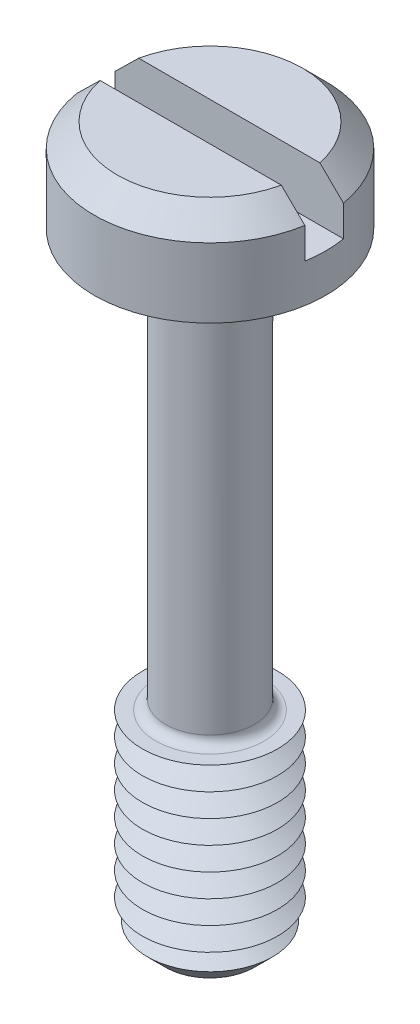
ISO-10303-21;
HEADER;
FILE_DESCRIPTION(('STEP AP214'),'2;1');
FILE_NAME('part.step','',(''),(''),'','','');
FILE_SCHEMA(('AUTOMOTIVE_DESIGN { 1 0 10303 214 1 1 1 1 }'));
ENDSEC;
DATA;
#1=APPLICATION_CONTEXT('core data for automotive mechanical design processes');
#2=APPLICATION_PROTOCOL_DEFINITION('international standard','automotive_design',2000,#1);
#3=PRODUCT_CONTEXT('',#1,'mechanical');
#4=PRODUCT('Part','Part','',(#3));
#5=PRODUCT_RELATED_PRODUCT_CATEGORY('part','',(#4));
#6=PRODUCT_DEFINITION_FORMATION('','',#4);
#7=PRODUCT_DEFINITION_CONTEXT('part definition',#1,'design');
#8=PRODUCT_DEFINITION('design','',#6,#7);
#9=PRODUCT_DEFINITION_SHAPE('','',#8);
#10=(LENGTH_UNIT() NAMED_UNIT(*) SI_UNIT(.MILLI.,.METRE.));
#11=(NAMED_UNIT(*) PLANE_ANGLE_UNIT() SI_UNIT($,.RADIAN.));
#12=(NAMED_UNIT(*) SI_UNIT($,.STERADIAN.) SOLID_ANGLE_UNIT());
#13=UNCERTAINTY_MEASURE_WITH_UNIT(LENGTH_MEASURE(1.E-05),#10,'distance_accuracy_value','');
#14=(GEOMETRIC_REPRESENTATION_CONTEXT(3) GLOBAL_UNCERTAINTY_ASSIGNED_CONTEXT((#13)) GLOBAL_UNIT_ASSIGNED_CONTEXT((#10,
#11,#12)) REPRESENTATION_CONTEXT('',''));
#15=CARTESIAN_POINT('',(0.,0.,0.));
#16=DIRECTION('',(0.,0.,1.));
#17=DIRECTION('',(1.,0.,0.));
#18=AXIS2_PLACEMENT_3D('',#15,#16,#17);
#19=CARTESIAN_POINT('',(0.,2.4,0.));
#20=DIRECTION('',(0.,1.,0.));
#21=DIRECTION('',(0.,0.,1.));
#22=AXIS2_PLACEMENT_3D('',#19,#20,#21);
#23=PLANE('',#22);
#24=DIRECTION('',(-1.,0.,0.));
#25=VECTOR('',#24,1.);
#26=CARTESIAN_POINT('',(3.,2.4,-0.5));
#27=LINE('',#26,#25);
#28=CARTESIAN_POINT('',(2.3473389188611,2.4,-0.5));
#29=VERTEX_POINT('',#28);
#30=CARTESIAN_POINT('',(-2.3473389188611,2.4,-0.5));
#31=VERTEX_POINT('',#30);
#32=EDGE_CURVE('E110',#29,#31,#27,.T.);
#33=ORIENTED_EDGE('',*,*,#32,.F.);
#34=CARTESIAN_POINT('',(0.,2.4,0.));
#35=DIRECTION('',(0.,1.,0.));
#36=DIRECTION('',(0.,0.,1.));
#37=AXIS2_PLACEMENT_3D('',#34,#35,#36);
#38=CIRCLE('',#37,2.4);
#39=EDGE_CURVE('E113',#29,#31,#38,.T.);
#40=ORIENTED_EDGE('',*,*,#39,.T.);
#41=EDGE_LOOP('',(#33,#40));
#42=FACE_BOUND('',#41,.T.);
#43=ADVANCED_FACE('F39',(#42),#23,.T.);
#44=CARTESIAN_POINT('',(0.,2.4,0.));
#45=DIRECTION('',(0.,-1.,0.));
#46=DIRECTION('',(0.,0.,-1.));
#47=AXIS2_PLACEMENT_3D('',#44,#45,#46);
#48=CONICAL_SURFACE('',#47,2.4,0.785398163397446);
#49=CARTESIAN_POINT('',(6.59924075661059,-1.81815522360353,-0.5));
#50=CARTESIAN_POINT('',(6.36552831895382,-1.58511655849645,-0.5));
#51=CARTESIAN_POINT('',(6.13178603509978,-1.3521077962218,-0.5));
#52=CARTESIAN_POINT('',(5.66419282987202,-0.886182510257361,-0.5));
#53=CARTESIAN_POINT('',(5.43034190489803,-0.653265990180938,-0.5));
#54=CARTESIAN_POINT('',(4.9622949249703,-0.187370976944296,-0.5));
#55=CARTESIAN_POINT('',(4.72809874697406,0.0456073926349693,-0.5));
#56=CARTESIAN_POINT('',(4.25949632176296,0.511336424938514,-0.5));
#57=CARTESIAN_POINT('',(4.02509008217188,0.744087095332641,-0.5));
#58=CARTESIAN_POINT('',(3.56605462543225,1.19918528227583,-0.5));
#59=CARTESIAN_POINT('',(3.34144041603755,1.42154792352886,-0.5));
#60=CARTESIAN_POINT('',(3.00406693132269,1.75465797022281,-0.5));
#61=CARTESIAN_POINT('',(2.89152775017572,1.8656282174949,-0.5));
#62=CARTESIAN_POINT('',(2.66624137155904,2.0873550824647,-0.5));
#63=CARTESIAN_POINT('',(2.5534941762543,2.19811170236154,-0.5));
#64=CARTESIAN_POINT('',(2.32775708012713,2.41925708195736,-0.5));
#65=CARTESIAN_POINT('',(2.21476734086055,2.52964600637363,-0.5));
#66=CARTESIAN_POINT('',(1.98831594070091,2.74994787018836,-0.5));
#67=CARTESIAN_POINT('',(1.87485426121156,2.85986079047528,-0.5));
#68=CARTESIAN_POINT('',(1.64719242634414,3.07888083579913,-0.5));
#69=CARTESIAN_POINT('',(1.53299241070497,3.18798810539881,-0.5));
#70=CARTESIAN_POINT('',(1.36063752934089,3.35052419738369,-0.5));
#71=CARTESIAN_POINT('',(1.30301197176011,3.40451369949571,-0.5));
#72=CARTESIAN_POINT('',(1.18725070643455,3.5119423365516,-0.5));
#73=CARTESIAN_POINT('',(1.12911501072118,3.56538148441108,-0.5));
#74=CARTESIAN_POINT('',(1.03810444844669,3.64783932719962,-0.5));
#75=CARTESIAN_POINT('',(1.0054935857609,3.67714917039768,-0.5));
#76=CARTESIAN_POINT('',(0.939964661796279,3.73543047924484,-0.5));
#77=CARTESIAN_POINT('',(0.907046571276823,3.76440191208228,-0.5));
#78=CARTESIAN_POINT('',(0.840581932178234,3.82209234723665,-0.5));
#79=CARTESIAN_POINT('',(0.807032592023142,3.85080814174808,-0.5));
#80=CARTESIAN_POINT('',(0.739406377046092,3.90759649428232,-0.5));
#81=CARTESIAN_POINT('',(0.705329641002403,3.93566921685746,-0.5));
#82=CARTESIAN_POINT('',(0.636165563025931,3.9911274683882,-0.5));
#83=CARTESIAN_POINT('',(0.601072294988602,4.01850564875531,-0.5));
#84=CARTESIAN_POINT('',(0.52984426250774,4.0718678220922,-0.5));
#85=CARTESIAN_POINT('',(0.493709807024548,4.09785222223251,-0.5));
#86=CARTESIAN_POINT('',(0.420142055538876,4.14747983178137,-0.5));
#87=CARTESIAN_POINT('',(0.382717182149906,4.17113535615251,-0.5));
#88=CARTESIAN_POINT('',(0.305809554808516,4.21475217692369,-0.5));
#89=CARTESIAN_POINT('',(0.26633263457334,4.234723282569,-0.5));
#90=CARTESIAN_POINT('',(0.194863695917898,4.26409059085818,-0.5));
#91=CARTESIAN_POINT('',(0.163467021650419,4.27488228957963,-0.5));
#92=CARTESIAN_POINT('',(0.0993951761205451,4.29114651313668,-0.5));
#93=CARTESIAN_POINT('',(0.0667267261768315,4.29664386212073,-0.5));
#94=CARTESIAN_POINT('',(0.000596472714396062,4.30109247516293,-0.5));
#95=CARTESIAN_POINT('',(-0.0328699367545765,4.29998037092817,-0.5));
#96=CARTESIAN_POINT('',(-0.0990204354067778,4.2913596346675,-0.5));
#97=CARTESIAN_POINT('',(-0.131701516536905,4.28382951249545,-0.5));
#98=CARTESIAN_POINT('',(-0.187595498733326,4.2664576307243,-0.5));
#99=CARTESIAN_POINT('',(-0.211151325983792,4.25764794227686,-0.5));
#100=CARTESIAN_POINT('',(-0.257419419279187,4.23801581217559,-0.5));
#101=CARTESIAN_POINT('',(-0.280131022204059,4.22719182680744,-0.5));
#102=CARTESIAN_POINT('',(-0.324887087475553,4.20402808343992,-0.5));
#103=CARTESIAN_POINT('',(-0.346927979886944,4.19168154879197,-0.5));
#104=CARTESIAN_POINT('',(-0.39035074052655,4.16590953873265,-0.5));
#105=CARTESIAN_POINT('',(-0.41173287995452,4.15248451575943,-0.5));
#106=CARTESIAN_POINT('',(-0.483200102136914,4.1057271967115,-0.5));
#107=CARTESIAN_POINT('',(-0.532069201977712,4.07054939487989,-0.5));
#108=CARTESIAN_POINT('',(-0.628034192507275,3.99783710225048,-0.5));
#109=CARTESIAN_POINT('',(-0.675128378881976,3.96030043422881,-0.5));
#110=CARTESIAN_POINT('',(-0.768277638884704,3.88373232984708,-0.5));
#111=CARTESIAN_POINT('',(-0.814329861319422,3.84469743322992,-0.5));
#112=CARTESIAN_POINT('',(-0.90564084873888,3.76575507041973,-0.5));
#113=CARTESIAN_POINT('',(-0.950899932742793,3.72584797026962,-0.5));
#114=CARTESIAN_POINT('',(-1.04097019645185,3.64535266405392,-0.5));
#115=CARTESIAN_POINT('',(-1.08578029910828,3.60476325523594,-0.5));
#116=CARTESIAN_POINT('',(-1.17501433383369,3.52315414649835,-0.5));
#117=CARTESIAN_POINT('',(-1.21943822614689,3.48213440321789,-0.5));
#118=CARTESIAN_POINT('',(-1.35214179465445,3.35874463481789,-0.5));
#119=CARTESIAN_POINT('',(-1.43999477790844,3.27591618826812,-0.5));
#120=CARTESIAN_POINT('',(-1.61421087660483,3.11033648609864,-0.5));
#121=CARTESIAN_POINT('',(-1.70058023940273,3.02759177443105,-0.5));
#122=CARTESIAN_POINT('',(-1.87288923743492,2.86165572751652,-0.5));
#123=CARTESIAN_POINT('',(-1.95882887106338,2.77846439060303,-0.5));
#124=CARTESIAN_POINT('',(-2.21622491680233,2.52844403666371,-0.5));
#125=CARTESIAN_POINT('',(-2.38725269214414,2.3611742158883,-0.5));
#126=CARTESIAN_POINT('',(-2.72882612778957,2.02593191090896,-0.5));
#127=CARTESIAN_POINT('',(-2.89937142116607,1.8579590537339,-0.5));
#128=CARTESIAN_POINT('',(-3.24010524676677,1.52165721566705,-0.5));
#129=CARTESIAN_POINT('',(-3.41029378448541,1.35332824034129,-0.5));
#130=CARTESIAN_POINT('',(-3.75003309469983,1.0168528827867,-0.5));
#131=CARTESIAN_POINT('',(-3.91958441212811,0.848707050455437,-0.5));
#132=CARTESIAN_POINT('',(-4.25853538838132,0.512261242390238,-0.5));
#133=CARTESIAN_POINT('',(-4.42793504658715,0.343961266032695,-0.5));
#134=CARTESIAN_POINT('',(-4.9359209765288,-0.16104405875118,-0.5));
#135=CARTESIAN_POINT('',(-5.27434871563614,-0.497908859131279,-0.5));
#136=CARTESIAN_POINT('',(-5.69486651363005,-0.916769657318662,-0.5));
#137=CARTESIAN_POINT('',(-5.77706453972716,-0.998657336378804,-0.5));
#138=CARTESIAN_POINT('',(-5.94145013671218,-1.16244746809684,-0.5));
#139=CARTESIAN_POINT('',(-6.02363770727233,-1.24434992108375,-0.5));
#140=CARTESIAN_POINT('',(-6.1880679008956,-1.40823159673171,-0.5));
#141=CARTESIAN_POINT('',(-6.27031051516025,-1.49021082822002,-0.5));
#142=CARTESIAN_POINT('',(-6.4347837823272,-1.65417699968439,-0.5));
#143=CARTESIAN_POINT('',(-6.51701443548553,-1.73616393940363,-0.5));
#144=CARTESIAN_POINT('',(-6.59924075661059,-1.81815522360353,-0.5));
#145=B_SPLINE_CURVE_WITH_KNOTS('',3,(#49,#50,#51,#52,#53,#54,#55,#56,#57,#58,#59,#60,#61,#62,
#63,#64,#65,#66,#67,#68,#69,#70,#71,#72,#73,#74,#75,#76,#77,#78,#79,#80,#81,#82,#83,#84,#85,#86,
#87,#88,#89,#90,#91,#92,#93,#94,#95,#96,#97,#98,#99,#100,#101,#102,#103,#104,#105,#106,#107,
#108,#109,#110,#111,#112,#113,#114,#115,#116,#117,#118,#119,#120,#121,#122,#123,#124,#125,#126,
#127,#128,#129,#130,#131,#132,#133,#134,#135,#136,#137,#138,#139,#140,#141,#142,#143,#144),
.UNSPECIFIED.,.F.,.F.,(4,2,2,2,2,2,2,2,2,2,2,2,2,2,2,2,2,2,2,2,2,2,2,2,2,2,2,2,2,2,2,2,2,2,2,2,
2,2,2,2,2,2,2,2,2,2,2,4),(0.,0.990129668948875,1.98029489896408,2.97132503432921,3.96232055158,
4.91051293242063,5.384659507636,5.85880117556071,6.3326899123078,6.80659750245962,
7.28041788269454,7.51731276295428,7.75420207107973,7.88574051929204,8.01729161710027,
8.14976780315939,8.28220970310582,8.41571746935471,8.54918601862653,8.68190589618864,
8.81426715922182,8.91354607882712,9.01235719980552,9.1121171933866,9.21221254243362,
9.28755627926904,9.36295799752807,9.43870832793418,9.51442704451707,9.69490147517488,
9.87554500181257,10.0566343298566,10.2376490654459,10.4190258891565,10.6004211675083,
10.9626397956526,11.3214656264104,11.6802927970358,12.3979711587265,13.1160968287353,
13.8342113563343,14.5505812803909,15.2669541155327,16.6994694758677,17.0475484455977,
17.3956364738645,17.7440040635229,18.0923625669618),.UNSPECIFIED.);
#146=CARTESIAN_POINT('',(2.95803989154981,1.8,-0.5));
#147=VERTEX_POINT('',#146);
#148=EDGE_CURVE('E259',#147,#29,#145,.T.);
#149=ORIENTED_EDGE('',*,*,#148,.F.);
#150=CARTESIAN_POINT('',(0.,1.8,0.));
#151=DIRECTION('',(0.,1.,0.));
#152=DIRECTION('',(0.,0.,1.));
#153=AXIS2_PLACEMENT_3D('',#150,#151,#152);
#154=CIRCLE('',#153,3.);
#155=CARTESIAN_POINT('',(-2.95803989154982,1.79999999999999,-0.5));
#156=VERTEX_POINT('',#155);
#157=EDGE_CURVE('E127',#156,#147,#154,.F.);
#158=ORIENTED_EDGE('',*,*,#157,.F.);
#159=EDGE_CURVE('E102',#31,#156,#145,.T.);
#160=ORIENTED_EDGE('',*,*,#159,.F.);
#161=ORIENTED_EDGE('',*,*,#39,.F.);
#162=EDGE_LOOP('',(#149,#158,#160,#161));
#163=FACE_BOUND('',#162,.T.);
#164=ADVANCED_FACE('F221',(#163),#48,.T.);
#165=CARTESIAN_POINT('',(0.,-16.,0.));
#166=DIRECTION('',(0.,1.,0.));
#167=DIRECTION('',(0.,0.,1.));
#168=AXIS2_PLACEMENT_3D('',#165,#166,#167);
#169=CYLINDRICAL_SURFACE('',#168,1.15);
#170=CARTESIAN_POINT('',(0.,-10.55,0.));
#171=DIRECTION('',(0.,-1.,0.));
#172=DIRECTION('',(0.,0.,-1.));
#173=AXIS2_PLACEMENT_3D('',#170,#171,#172);
#174=CIRCLE('',#173,1.15);
#175=CARTESIAN_POINT('',(0.,-10.55,-1.15));
#176=VERTEX_POINT('',#175);
#177=EDGE_CURVE('E122',#176,#176,#174,.F.);
#178=ORIENTED_EDGE('',*,*,#177,.T.);
#179=EDGE_LOOP('',(#178));
#180=FACE_BOUND('',#179,.T.);
#181=CARTESIAN_POINT('',(0.,-0.25,0.));
#182=DIRECTION('',(0.,1.,0.));
#183=DIRECTION('',(0.,0.,1.));
#184=AXIS2_PLACEMENT_3D('',#181,#182,#183);
#185=CIRCLE('',#184,1.15);
#186=CARTESIAN_POINT('',(0.,-0.25,1.15));
#187=VERTEX_POINT('',#186);
#188=EDGE_CURVE('E366',#187,#187,#185,.F.);
#189=ORIENTED_EDGE('',*,*,#188,.T.);
#190=EDGE_LOOP('',(#189));
#191=FACE_BOUND('',#190,.T.);
#192=ADVANCED_FACE('F217',(#180,#191),#169,.T.);
#193=CARTESIAN_POINT('',(0.,2.4,0.));
#194=DIRECTION('',(0.,-1.,0.));
#195=DIRECTION('',(0.,0.,-1.));
#196=AXIS2_PLACEMENT_3D('',#193,#194,#195);
#197=CYLINDRICAL_SURFACE('',#196,3.);
#198=ORIENTED_EDGE('',*,*,#157,.T.);
#199=DIRECTION('',(0.,-1.,0.));
#200=VECTOR('',#199,1.);
#201=CARTESIAN_POINT('',(2.95803989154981,2.4,-0.5));
#202=LINE('',#201,#200);
#203=CARTESIAN_POINT('',(2.95803989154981,1.,-0.5));
#204=VERTEX_POINT('',#203);
#205=EDGE_CURVE('E64',#147,#204,#202,.T.);
#206=ORIENTED_EDGE('',*,*,#205,.T.);
#207=CARTESIAN_POINT('',(0.,1.,0.));
#208=DIRECTION('',(0.,1.,0.));
#209=DIRECTION('',(0.,0.,1.));
#210=AXIS2_PLACEMENT_3D('',#207,#208,#209);
#211=CIRCLE('',#210,3.);
#212=CARTESIAN_POINT('',(2.95803989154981,1.,0.5));
#213=VERTEX_POINT('',#212);
#214=EDGE_CURVE('E11',#213,#204,#211,.T.);
#215=ORIENTED_EDGE('',*,*,#214,.F.);
#216=DIRECTION('',(0.,-1.,0.));
#217=VECTOR('',#216,1.);
#218=CARTESIAN_POINT('',(2.95803989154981,2.4,0.5));
#219=LINE('',#218,#217);
#220=CARTESIAN_POINT('',(2.95803989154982,1.79999999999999,0.5));
#221=VERTEX_POINT('',#220);
#222=EDGE_CURVE('E276',#213,#221,#219,.F.);
#223=ORIENTED_EDGE('',*,*,#222,.T.);
#224=CARTESIAN_POINT('',(-2.95803989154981,1.8,0.5));
#225=VERTEX_POINT('',#224);
#226=EDGE_CURVE('E120',#221,#225,#154,.F.);
#227=ORIENTED_EDGE('',*,*,#226,.T.);
#228=DIRECTION('',(0.,-1.,0.));
#229=VECTOR('',#228,1.);
#230=CARTESIAN_POINT('',(-2.95803989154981,2.4,0.5));
#231=LINE('',#230,#229);
#232=CARTESIAN_POINT('',(-2.95803989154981,1.,0.5));
#233=VERTEX_POINT('',#232);
#234=EDGE_CURVE('E96',#225,#233,#231,.T.);
#235=ORIENTED_EDGE('',*,*,#234,.T.);
#236=CARTESIAN_POINT('',(-2.95803989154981,1.,-0.5));
#237=VERTEX_POINT('',#236);
#238=EDGE_CURVE('E44',#237,#233,#211,.T.);
#239=ORIENTED_EDGE('',*,*,#238,.F.);
#240=DIRECTION('',(0.,-1.,0.));
#241=VECTOR('',#240,1.);
#242=CARTESIAN_POINT('',(-2.95803989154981,2.4,-0.5));
#243=LINE('',#242,#241);
#244=EDGE_CURVE('E280',#237,#156,#243,.F.);
#245=ORIENTED_EDGE('',*,*,#244,.T.);
#246=EDGE_LOOP('',(#198,#206,#215,#223,#227,#235,#239,#245));
#247=FACE_BOUND('',#246,.T.);
#248=CARTESIAN_POINT('',(0.,0.,0.));
#249=DIRECTION('',(0.,1.,0.));
#250=DIRECTION('',(0.,0.,1.));
#251=AXIS2_PLACEMENT_3D('',#248,#249,#250);
#252=CIRCLE('',#251,3.);
#253=CARTESIAN_POINT('',(0.,0.,3.));
#254=VERTEX_POINT('',#253);
#255=EDGE_CURVE('E351',#254,#254,#252,.T.);
#256=ORIENTED_EDGE('',*,*,#255,.T.);
#257=EDGE_LOOP('',(#256));
#258=FACE_BOUND('',#257,.T.);
#259=ADVANCED_FACE('F220',(#247,#258),#197,.T.);
#260=DIRECTION('',(1.,0.,0.));
#261=VECTOR('',#260,1.);
#262=CARTESIAN_POINT('',(3.,2.4,0.5));
#263=LINE('',#262,#261);
#264=CARTESIAN_POINT('',(-2.3473389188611,2.4,0.5));
#265=VERTEX_POINT('',#264);
#266=CARTESIAN_POINT('',(2.3473389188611,2.4,0.5));
#267=VERTEX_POINT('',#266);
#268=EDGE_CURVE('E56',#265,#267,#263,.T.);
#269=ORIENTED_EDGE('',*,*,#268,.F.);
#270=EDGE_CURVE('E108',#265,#267,#38,.T.);
#271=ORIENTED_EDGE('',*,*,#270,.T.);
#272=EDGE_LOOP('',(#269,#271));
#273=FACE_BOUND('',#272,.T.);
#274=ADVANCED_FACE('F107',(#273),#23,.T.);
#275=CARTESIAN_POINT('',(0.,0.,0.));
#276=DIRECTION('',(0.,1.,0.));
#277=DIRECTION('',(0.,0.,1.));
#278=AXIS2_PLACEMENT_3D('',#275,#276,#277);
#279=PLANE('',#278);
#280=CARTESIAN_POINT('',(0.,0.,0.));
#281=DIRECTION('',(0.,1.,0.));
#282=DIRECTION('',(0.,0.,1.));
#283=AXIS2_PLACEMENT_3D('',#280,#281,#282);
#284=CIRCLE('',#283,1.4);
#285=CARTESIAN_POINT('',(0.,0.,1.4));
#286=VERTEX_POINT('',#285);
#287=EDGE_CURVE('E114',#286,#286,#284,.T.);
#288=ORIENTED_EDGE('',*,*,#287,.T.);
#289=EDGE_LOOP('',(#288));
#290=FACE_BOUND('',#289,.T.);
#291=ORIENTED_EDGE('',*,*,#255,.F.);
#292=EDGE_LOOP('',(#291));
#293=FACE_BOUND('',#292,.T.);
#294=ADVANCED_FACE('F211',(#290,#293),#279,.F.);
#295=CARTESIAN_POINT('',(0.,-10.8,0.));
#296=DIRECTION('',(0.,-1.,0.));
#297=DIRECTION('',(0.,0.,-1.));
#298=AXIS2_PLACEMENT_3D('',#295,#296,#297);
#299=PLANE('',#298);
#300=CARTESIAN_POINT('',(0.,-10.8,0.));
#301=DIRECTION('',(0.,-1.,0.));
#302=DIRECTION('',(0.,0.,-1.));
#303=AXIS2_PLACEMENT_3D('',#300,#301,#302);
#304=CIRCLE('',#303,1.4);
#305=CARTESIAN_POINT('',(0.,-10.8,-1.4));
#306=VERTEX_POINT('',#305);
#307=EDGE_CURVE('E359',#306,#306,#304,.T.);
#308=ORIENTED_EDGE('',*,*,#307,.T.);
#309=EDGE_LOOP('',(#308));
#310=FACE_BOUND('',#309,.T.);
#311=CARTESIAN_POINT('',(0.,-10.8,0.));
#312=DIRECTION('',(0.,1.,0.));
#313=DIRECTION('',(0.,0.,1.));
#314=AXIS2_PLACEMENT_3D('',#311,#312,#313);
#315=CIRCLE('',#314,1.75);
#316=CARTESIAN_POINT('',(0.,-10.8,1.75));
#317=VERTEX_POINT('',#316);
#318=EDGE_CURVE('E347',#317,#317,#315,.T.);
#319=ORIENTED_EDGE('',*,*,#318,.T.);
#320=EDGE_LOOP('',(#319));
#321=FACE_BOUND('',#320,.T.);
#322=ADVANCED_FACE('F207',(#310,#321),#299,.F.);
#323=CARTESIAN_POINT('',(0.,-11.1,0.));
#324=DIRECTION('',(0.,1.,0.));
#325=DIRECTION('',(0.,0.,1.));
#326=AXIS2_PLACEMENT_3D('',#323,#324,#325);
#327=CONICAL_SURFACE('',#326,1.23038475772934,1.0471975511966);
#328=ORIENTED_EDGE('',*,*,#318,.F.);
#329=EDGE_LOOP('',(#328));
#330=FACE_BOUND('',#329,.T.);
#331=CARTESIAN_POINT('',(0.,-11.1,0.));
#332=DIRECTION('',(0.,1.,0.));
#333=DIRECTION('',(0.,0.,1.));
#334=AXIS2_PLACEMENT_3D('',#331,#332,#333);
#335=CIRCLE('',#334,1.23038475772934);
#336=CARTESIAN_POINT('',(0.,-11.1,1.23038475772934));
#337=VERTEX_POINT('',#336);
#338=EDGE_CURVE('E344',#337,#337,#335,.T.);
#339=ORIENTED_EDGE('',*,*,#338,.T.);
#340=EDGE_LOOP('',(#339));
#341=FACE_BOUND('',#340,.T.);
#342=ADVANCED_FACE('F203',(#330,#341),#327,.T.);
#343=CARTESIAN_POINT('',(0.,-11.4,0.));
#344=DIRECTION('',(0.,-1.,0.));
#345=DIRECTION('',(0.,0.,-1.));
#346=AXIS2_PLACEMENT_3D('',#343,#344,#345);
#347=CONICAL_SURFACE('',#346,1.75,1.0471975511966);
#348=ORIENTED_EDGE('',*,*,#338,.F.);
#349=EDGE_LOOP('',(#348));
#350=FACE_BOUND('',#349,.T.);
#351=CARTESIAN_POINT('',(0.,-11.4,0.));
#352=DIRECTION('',(0.,1.,0.));
#353=DIRECTION('',(0.,0.,1.));
#354=AXIS2_PLACEMENT_3D('',#351,#352,#353);
#355=CIRCLE('',#354,1.75);
#356=CARTESIAN_POINT('',(0.,-11.4,1.75));
#357=VERTEX_POINT('',#356);
#358=EDGE_CURVE('E340',#357,#357,#355,.T.);
#359=ORIENTED_EDGE('',*,*,#358,.T.);
#360=EDGE_LOOP('',(#359));
#361=FACE_BOUND('',#360,.T.);
#362=ADVANCED_FACE('F199',(#350,#361),#347,.T.);
#363=CARTESIAN_POINT('',(0.,-11.7,0.));
#364=DIRECTION('',(0.,1.,0.));
#365=DIRECTION('',(0.,0.,1.));
#366=AXIS2_PLACEMENT_3D('',#363,#364,#365);
#367=CONICAL_SURFACE('',#366,1.23038475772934,1.0471975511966);
#368=ORIENTED_EDGE('',*,*,#358,.F.);
#369=EDGE_LOOP('',(#368));
#370=FACE_BOUND('',#369,.T.);
#371=CARTESIAN_POINT('',(0.,-11.7,0.));
#372=DIRECTION('',(0.,1.,0.));
#373=DIRECTION('',(0.,0.,1.));
#374=AXIS2_PLACEMENT_3D('',#371,#372,#373);
#375=CIRCLE('',#374,1.23038475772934);
#376=CARTESIAN_POINT('',(0.,-11.7,1.23038475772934));
#377=VERTEX_POINT('',#376);
#378=EDGE_CURVE('E337',#377,#377,#375,.T.);
#379=ORIENTED_EDGE('',*,*,#378,.T.);
#380=EDGE_LOOP('',(#379));
#381=FACE_BOUND('',#380,.T.);
#382=ADVANCED_FACE('F195',(#370,#381),#367,.T.);
#383=CARTESIAN_POINT('',(0.,-12.,0.));
#384=DIRECTION('',(0.,-1.,0.));
#385=DIRECTION('',(0.,0.,-1.));
#386=AXIS2_PLACEMENT_3D('',#383,#384,#385);
#387=CONICAL_SURFACE('',#386,1.75,1.0471975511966);
#388=ORIENTED_EDGE('',*,*,#378,.F.);
#389=EDGE_LOOP('',(#388));
#390=FACE_BOUND('',#389,.T.);
#391=CARTESIAN_POINT('',(0.,-12.,0.));
#392=DIRECTION('',(0.,1.,0.));
#393=DIRECTION('',(0.,0.,1.));
#394=AXIS2_PLACEMENT_3D('',#391,#392,#393);
#395=CIRCLE('',#394,1.75);
#396=CARTESIAN_POINT('',(0.,-12.,1.75));
#397=VERTEX_POINT('',#396);
#398=EDGE_CURVE('E334',#397,#397,#395,.T.);
#399=ORIENTED_EDGE('',*,*,#398,.T.);
#400=EDGE_LOOP('',(#399));
#401=FACE_BOUND('',#400,.T.);
#402=ADVANCED_FACE('F191',(#390,#401),#387,.T.);
#403=CARTESIAN_POINT('',(0.,-12.3,0.));
#404=DIRECTION('',(0.,1.,0.));
#405=DIRECTION('',(0.,0.,1.));
#406=AXIS2_PLACEMENT_3D('',#403,#404,#405);
#407=CONICAL_SURFACE('',#406,1.23038475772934,1.0471975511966);
#408=ORIENTED_EDGE('',*,*,#398,.F.);
#409=EDGE_LOOP('',(#408));
#410=FACE_BOUND('',#409,.T.);
#411=CARTESIAN_POINT('',(0.,-12.3,0.));
#412=DIRECTION('',(0.,1.,0.));
#413=DIRECTION('',(0.,0.,1.));
#414=AXIS2_PLACEMENT_3D('',#411,#412,#413);
#415=CIRCLE('',#414,1.23038475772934);
#416=CARTESIAN_POINT('',(0.,-12.3,1.23038475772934));
#417=VERTEX_POINT('',#416);
#418=EDGE_CURVE('E330',#417,#417,#415,.T.);
#419=ORIENTED_EDGE('',*,*,#418,.T.);
#420=EDGE_LOOP('',(#419));
#421=FACE_BOUND('',#420,.T.);
#422=ADVANCED_FACE('F187',(#410,#421),#407,.T.);
#423=CARTESIAN_POINT('',(0.,-12.6,0.));
#424=DIRECTION('',(0.,-1.,0.));
#425=DIRECTION('',(0.,0.,-1.));
#426=AXIS2_PLACEMENT_3D('',#423,#424,#425);
#427=CONICAL_SURFACE('',#426,1.75,1.0471975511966);
#428=ORIENTED_EDGE('',*,*,#418,.F.);
#429=EDGE_LOOP('',(#428));
#430=FACE_BOUND('',#429,.T.);
#431=CARTESIAN_POINT('',(0.,-12.6,0.));
#432=DIRECTION('',(0.,1.,0.));
#433=DIRECTION('',(0.,0.,1.));
#434=AXIS2_PLACEMENT_3D('',#431,#432,#433);
#435=CIRCLE('',#434,1.75);
#436=CARTESIAN_POINT('',(0.,-12.6,1.75));
#437=VERTEX_POINT('',#436);
#438=EDGE_CURVE('E326',#437,#437,#435,.T.);
#439=ORIENTED_EDGE('',*,*,#438,.T.);
#440=EDGE_LOOP('',(#439));
#441=FACE_BOUND('',#440,.T.);
#442=ADVANCED_FACE('F183',(#430,#441),#427,.T.);
#443=CARTESIAN_POINT('',(0.,-12.9,0.));
#444=DIRECTION('',(0.,1.,0.));
#445=DIRECTION('',(0.,0.,1.));
#446=AXIS2_PLACEMENT_3D('',#443,#444,#445);
#447=CONICAL_SURFACE('',#446,1.23038475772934,1.0471975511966);
#448=ORIENTED_EDGE('',*,*,#438,.F.);
#449=EDGE_LOOP('',(#448));
#450=FACE_BOUND('',#449,.T.);
#451=CARTESIAN_POINT('',(0.,-12.9,0.));
#452=DIRECTION('',(0.,1.,0.));
#453=DIRECTION('',(0.,0.,1.));
#454=AXIS2_PLACEMENT_3D('',#451,#452,#453);
#455=CIRCLE('',#454,1.23038475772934);
#456=CARTESIAN_POINT('',(0.,-12.9,1.23038475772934));
#457=VERTEX_POINT('',#456);
#458=EDGE_CURVE('E322',#457,#457,#455,.T.);
#459=ORIENTED_EDGE('',*,*,#458,.T.);
#460=EDGE_LOOP('',(#459));
#461=FACE_BOUND('',#460,.T.);
#462=ADVANCED_FACE('F179',(#450,#461),#447,.T.);
#463=CARTESIAN_POINT('',(0.,-13.2,0.));
#464=DIRECTION('',(0.,-1.,0.));
#465=DIRECTION('',(0.,0.,-1.));
#466=AXIS2_PLACEMENT_3D('',#463,#464,#465);
#467=CONICAL_SURFACE('',#466,1.75,1.0471975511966);
#468=ORIENTED_EDGE('',*,*,#458,.F.);
#469=EDGE_LOOP('',(#468));
#470=FACE_BOUND('',#469,.T.);
#471=CARTESIAN_POINT('',(0.,-13.2,0.));
#472=DIRECTION('',(0.,1.,0.));
#473=DIRECTION('',(0.,0.,1.));
#474=AXIS2_PLACEMENT_3D('',#471,#472,#473);
#475=CIRCLE('',#474,1.75);
#476=CARTESIAN_POINT('',(0.,-13.2,1.75));
#477=VERTEX_POINT('',#476);
#478=EDGE_CURVE('E318',#477,#477,#475,.T.);
#479=ORIENTED_EDGE('',*,*,#478,.T.);
#480=EDGE_LOOP('',(#479));
#481=FACE_BOUND('',#480,.T.);
#482=ADVANCED_FACE('F175',(#470,#481),#467,.T.);
#483=CARTESIAN_POINT('',(0.,-13.5,0.));
#484=DIRECTION('',(0.,1.,0.));
#485=DIRECTION('',(0.,0.,1.));
#486=AXIS2_PLACEMENT_3D('',#483,#484,#485);
#487=CONICAL_SURFACE('',#486,1.23038475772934,1.0471975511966);
#488=ORIENTED_EDGE('',*,*,#478,.F.);
#489=EDGE_LOOP('',(#488));
#490=FACE_BOUND('',#489,.T.);
#491=CARTESIAN_POINT('',(0.,-13.5,0.));
#492=DIRECTION('',(0.,1.,0.));
#493=DIRECTION('',(0.,0.,1.));
#494=AXIS2_PLACEMENT_3D('',#491,#492,#493);
#495=CIRCLE('',#494,1.23038475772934);
#496=CARTESIAN_POINT('',(0.,-13.5,1.23038475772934));
#497=VERTEX_POINT('',#496);
#498=EDGE_CURVE('E314',#497,#497,#495,.T.);
#499=ORIENTED_EDGE('',*,*,#498,.T.);
#500=EDGE_LOOP('',(#499));
#501=FACE_BOUND('',#500,.T.);
#502=ADVANCED_FACE('F171',(#490,#501),#487,.T.);
#503=CARTESIAN_POINT('',(0.,-13.8,0.));
#504=DIRECTION('',(0.,-1.,0.));
#505=DIRECTION('',(0.,0.,-1.));
#506=AXIS2_PLACEMENT_3D('',#503,#504,#505);
#507=CONICAL_SURFACE('',#506,1.75,1.0471975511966);
#508=ORIENTED_EDGE('',*,*,#498,.F.);
#509=EDGE_LOOP('',(#508));
#510=FACE_BOUND('',#509,.T.);
#511=CARTESIAN_POINT('',(0.,-13.8,0.));
#512=DIRECTION('',(0.,1.,0.));
#513=DIRECTION('',(0.,0.,1.));
#514=AXIS2_PLACEMENT_3D('',#511,#512,#513);
#515=CIRCLE('',#514,1.75);
#516=CARTESIAN_POINT('',(0.,-13.8,1.75));
#517=VERTEX_POINT('',#516);
#518=EDGE_CURVE('E310',#517,#517,#515,.T.);
#519=ORIENTED_EDGE('',*,*,#518,.T.);
#520=EDGE_LOOP('',(#519));
#521=FACE_BOUND('',#520,.T.);
#522=ADVANCED_FACE('F167',(#510,#521),#507,.T.);
#523=CARTESIAN_POINT('',(0.,-14.1,0.));
#524=DIRECTION('',(0.,1.,0.));
#525=DIRECTION('',(0.,0.,1.));
#526=AXIS2_PLACEMENT_3D('',#523,#524,#525);
#527=CONICAL_SURFACE('',#526,1.23038475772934,1.0471975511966);
#528=ORIENTED_EDGE('',*,*,#518,.F.);
#529=EDGE_LOOP('',(#528));
#530=FACE_BOUND('',#529,.T.);
#531=CARTESIAN_POINT('',(0.,-14.1,0.));
#532=DIRECTION('',(0.,1.,0.));
#533=DIRECTION('',(0.,0.,1.));
#534=AXIS2_PLACEMENT_3D('',#531,#532,#533);
#535=CIRCLE('',#534,1.23038475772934);
#536=CARTESIAN_POINT('',(0.,-14.1,1.23038475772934));
#537=VERTEX_POINT('',#536);
#538=EDGE_CURVE('E306',#537,#537,#535,.T.);
#539=ORIENTED_EDGE('',*,*,#538,.T.);
#540=EDGE_LOOP('',(#539));
#541=FACE_BOUND('',#540,.T.);
#542=ADVANCED_FACE('F163',(#530,#541),#527,.T.);
#543=CARTESIAN_POINT('',(0.,-14.4,0.));
#544=DIRECTION('',(0.,-1.,0.));
#545=DIRECTION('',(0.,0.,-1.));
#546=AXIS2_PLACEMENT_3D('',#543,#544,#545);
#547=CONICAL_SURFACE('',#546,1.75,1.0471975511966);
#548=ORIENTED_EDGE('',*,*,#538,.F.);
#549=EDGE_LOOP('',(#548));
#550=FACE_BOUND('',#549,.T.);
#551=CARTESIAN_POINT('',(0.,-14.4,0.));
#552=DIRECTION('',(0.,1.,0.));
#553=DIRECTION('',(0.,0.,1.));
#554=AXIS2_PLACEMENT_3D('',#551,#552,#553);
#555=CIRCLE('',#554,1.75);
#556=CARTESIAN_POINT('',(0.,-14.4,1.75));
#557=VERTEX_POINT('',#556);
#558=EDGE_CURVE('E302',#557,#557,#555,.T.);
#559=ORIENTED_EDGE('',*,*,#558,.T.);
#560=EDGE_LOOP('',(#559));
#561=FACE_BOUND('',#560,.T.);
#562=ADVANCED_FACE('F159',(#550,#561),#547,.T.);
#563=CARTESIAN_POINT('',(0.,-14.7,0.));
#564=DIRECTION('',(0.,1.,0.));
#565=DIRECTION('',(0.,0.,1.));
#566=AXIS2_PLACEMENT_3D('',#563,#564,#565);
#567=CONICAL_SURFACE('',#566,1.23038475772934,1.0471975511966);
#568=ORIENTED_EDGE('',*,*,#558,.F.);
#569=EDGE_LOOP('',(#568));
#570=FACE_BOUND('',#569,.T.);
#571=CARTESIAN_POINT('',(0.,-14.7,0.));
#572=DIRECTION('',(0.,1.,0.));
#573=DIRECTION('',(0.,0.,1.));
#574=AXIS2_PLACEMENT_3D('',#571,#572,#573);
#575=CIRCLE('',#574,1.23038475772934);
#576=CARTESIAN_POINT('',(0.,-14.7,1.23038475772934));
#577=VERTEX_POINT('',#576);
#578=EDGE_CURVE('E298',#577,#577,#575,.T.);
#579=ORIENTED_EDGE('',*,*,#578,.T.);
#580=EDGE_LOOP('',(#579));
#581=FACE_BOUND('',#580,.T.);
#582=ADVANCED_FACE('F155',(#570,#581),#567,.T.);
#583=CARTESIAN_POINT('',(0.,-15.,0.));
#584=DIRECTION('',(0.,-1.,0.));
#585=DIRECTION('',(0.,0.,-1.));
#586=AXIS2_PLACEMENT_3D('',#583,#584,#585);
#587=CONICAL_SURFACE('',#586,1.75,1.0471975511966);
#588=ORIENTED_EDGE('',*,*,#578,.F.);
#589=EDGE_LOOP('',(#588));
#590=FACE_BOUND('',#589,.T.);
#591=CARTESIAN_POINT('',(0.,-15.,0.));
#592=DIRECTION('',(0.,1.,0.));
#593=DIRECTION('',(0.,0.,1.));
#594=AXIS2_PLACEMENT_3D('',#591,#592,#593);
#595=CIRCLE('',#594,1.75);
#596=CARTESIAN_POINT('',(0.,-15.,1.75));
#597=VERTEX_POINT('',#596);
#598=EDGE_CURVE('E294',#597,#597,#595,.T.);
#599=ORIENTED_EDGE('',*,*,#598,.T.);
#600=EDGE_LOOP('',(#599));
#601=FACE_BOUND('',#600,.T.);
#602=ADVANCED_FACE('F151',(#590,#601),#587,.T.);
#603=CARTESIAN_POINT('',(0.,-15.3,0.));
#604=DIRECTION('',(0.,1.,0.));
#605=DIRECTION('',(0.,0.,1.));
#606=AXIS2_PLACEMENT_3D('',#603,#604,#605);
#607=CONICAL_SURFACE('',#606,1.23038475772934,1.0471975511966);
#608=ORIENTED_EDGE('',*,*,#598,.F.);
#609=EDGE_LOOP('',(#608));
#610=FACE_BOUND('',#609,.T.);
#611=CARTESIAN_POINT('',(0.,-15.3,0.));
#612=DIRECTION('',(0.,1.,0.));
#613=DIRECTION('',(0.,0.,1.));
#614=AXIS2_PLACEMENT_3D('',#611,#612,#613);
#615=CIRCLE('',#614,1.23038475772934);
#616=CARTESIAN_POINT('',(0.,-15.3,1.23038475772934));
#617=VERTEX_POINT('',#616);
#618=EDGE_CURVE('E290',#617,#617,#615,.T.);
#619=ORIENTED_EDGE('',*,*,#618,.T.);
#620=EDGE_LOOP('',(#619));
#621=FACE_BOUND('',#620,.T.);
#622=ADVANCED_FACE('F147',(#610,#621),#607,.T.);
#623=CARTESIAN_POINT('',(0.,-15.6,0.));
#624=DIRECTION('',(0.,-1.,0.));
#625=DIRECTION('',(0.,0.,-1.));
#626=AXIS2_PLACEMENT_3D('',#623,#624,#625);
#627=CONICAL_SURFACE('',#626,1.75,1.0471975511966);
#628=CARTESIAN_POINT('',(0.,-15.5267949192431,0.));
#629=DIRECTION('',(0.,-1.,0.));
#630=DIRECTION('',(0.,0.,-1.));
#631=AXIS2_PLACEMENT_3D('',#628,#629,#630);
#632=CIRCLE('',#631,1.62320508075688);
#633=CARTESIAN_POINT('',(0.,-15.5267949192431,-1.62320508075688));
#634=VERTEX_POINT('',#633);
#635=EDGE_CURVE('E297',#634,#634,#632,.F.);
#636=ORIENTED_EDGE('',*,*,#635,.T.);
#637=EDGE_LOOP('',(#636));
#638=FACE_BOUND('',#637,.T.);
#639=ORIENTED_EDGE('',*,*,#618,.F.);
#640=EDGE_LOOP('',(#639));
#641=FACE_BOUND('',#640,.T.);
#642=ADVANCED_FACE('F143',(#638,#641),#627,.T.);
#643=CARTESIAN_POINT('',(0.,-16.,0.));
#644=DIRECTION('',(0.,-1.,0.));
#645=DIRECTION('',(0.,0.,-1.));
#646=AXIS2_PLACEMENT_3D('',#643,#644,#645);
#647=PLANE('',#646);
#648=CARTESIAN_POINT('',(0.,-16.,0.));
#649=DIRECTION('',(0.,-1.,0.));
#650=DIRECTION('',(0.,0.,-1.));
#651=AXIS2_PLACEMENT_3D('',#648,#649,#650);
#652=CIRCLE('',#651,1.15);
#653=CARTESIAN_POINT('',(0.,-16.,-1.15));
#654=VERTEX_POINT('',#653);
#655=EDGE_CURVE('E355',#654,#654,#652,.T.);
#656=ORIENTED_EDGE('',*,*,#655,.T.);
#657=EDGE_LOOP('',(#656));
#658=FACE_BOUND('',#657,.T.);
#659=ADVANCED_FACE('F146',(#658),#647,.T.);
#660=CARTESIAN_POINT('',(0.,-16.,0.));
#661=DIRECTION('',(0.,1.,0.));
#662=DIRECTION('',(0.,0.,1.));
#663=AXIS2_PLACEMENT_3D('',#660,#661,#662);
#664=CONICAL_SURFACE('',#663,1.15,0.785398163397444);
#665=ORIENTED_EDGE('',*,*,#635,.F.);
#666=EDGE_LOOP('',(#665));
#667=FACE_BOUND('',#666,.T.);
#668=ORIENTED_EDGE('',*,*,#655,.F.);
#669=EDGE_LOOP('',(#668));
#670=FACE_BOUND('',#669,.T.);
#671=ADVANCED_FACE('F215',(#667,#670),#664,.T.);
#672=CARTESIAN_POINT('',(0.,-10.55,0.));
#673=DIRECTION('',(0.,-1.,0.));
#674=DIRECTION('',(0.,0.,-1.));
#675=AXIS2_PLACEMENT_3D('',#672,#673,#674);
#676=TOROIDAL_SURFACE('',#675,1.4,0.25);
#677=ORIENTED_EDGE('',*,*,#177,.F.);
#678=EDGE_LOOP('',(#677));
#679=FACE_BOUND('',#678,.T.);
#680=ORIENTED_EDGE('',*,*,#307,.F.);
#681=EDGE_LOOP('',(#680));
#682=FACE_BOUND('',#681,.T.);
#683=ADVANCED_FACE('F233',(#679,#682),#676,.F.);
#684=CARTESIAN_POINT('',(0.,-0.25,0.));
#685=DIRECTION('',(0.,1.,0.));
#686=DIRECTION('',(0.,0.,1.));
#687=AXIS2_PLACEMENT_3D('',#684,#685,#686);
#688=TOROIDAL_SURFACE('',#687,1.4,0.25);
#689=ORIENTED_EDGE('',*,*,#287,.F.);
#690=EDGE_LOOP('',(#689));
#691=FACE_BOUND('',#690,.T.);
#692=ORIENTED_EDGE('',*,*,#188,.F.);
#693=EDGE_LOOP('',(#692));
#694=FACE_BOUND('',#693,.T.);
#695=ADVANCED_FACE('F236',(#691,#694),#688,.F.);
#696=CARTESIAN_POINT('',(-6.59924075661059,-1.81815522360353,0.5));
#697=CARTESIAN_POINT('',(-6.36552831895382,-1.58511655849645,0.5));
#698=CARTESIAN_POINT('',(-6.13178603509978,-1.3521077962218,0.5));
#699=CARTESIAN_POINT('',(-5.66419282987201,-0.886182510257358,0.5));
#700=CARTESIAN_POINT('',(-5.43034190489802,-0.653265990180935,0.5));
#701=CARTESIAN_POINT('',(-4.9622949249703,-0.187370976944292,0.5));
#702=CARTESIAN_POINT('',(-4.72809874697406,0.0456073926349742,0.5));
#703=CARTESIAN_POINT('',(-4.25949632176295,0.511336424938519,0.5));
#704=CARTESIAN_POINT('',(-4.02509008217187,0.744087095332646,0.5));
#705=CARTESIAN_POINT('',(-3.56605462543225,1.19918528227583,0.5));
#706=CARTESIAN_POINT('',(-3.34144041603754,1.42154792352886,0.5));
#707=CARTESIAN_POINT('',(-3.00406693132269,1.75465797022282,0.5));
#708=CARTESIAN_POINT('',(-2.89152775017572,1.8656282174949,0.5));
#709=CARTESIAN_POINT('',(-2.66624137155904,2.08735508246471,0.5));
#710=CARTESIAN_POINT('',(-2.5534941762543,2.19811170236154,0.5));
#711=CARTESIAN_POINT('',(-2.32775708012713,2.41925708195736,0.5));
#712=CARTESIAN_POINT('',(-2.21476734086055,2.52964600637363,0.5));
#713=CARTESIAN_POINT('',(-1.98831594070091,2.74994787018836,0.5));
#714=CARTESIAN_POINT('',(-1.87485426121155,2.85986079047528,0.5));
#715=CARTESIAN_POINT('',(-1.64719242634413,3.07888083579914,0.5));
#716=CARTESIAN_POINT('',(-1.53299241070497,3.18798810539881,0.5));
#717=CARTESIAN_POINT('',(-1.36063752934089,3.35052419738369,0.5));
#718=CARTESIAN_POINT('',(-1.30301197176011,3.40451369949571,0.5));
#719=CARTESIAN_POINT('',(-1.18725070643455,3.5119423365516,0.5));
#720=CARTESIAN_POINT('',(-1.12911501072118,3.56538148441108,0.5));
#721=CARTESIAN_POINT('',(-1.03810444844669,3.64783932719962,0.5));
#722=CARTESIAN_POINT('',(-1.0054935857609,3.67714917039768,0.5));
#723=CARTESIAN_POINT('',(-0.939964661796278,3.73543047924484,0.5));
#724=CARTESIAN_POINT('',(-0.907046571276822,3.76440191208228,0.5));
#725=CARTESIAN_POINT('',(-0.840581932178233,3.82209234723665,0.5));
#726=CARTESIAN_POINT('',(-0.807032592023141,3.85080814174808,0.5));
#727=CARTESIAN_POINT('',(-0.739406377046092,3.90759649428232,0.5));
#728=CARTESIAN_POINT('',(-0.705329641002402,3.93566921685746,0.5));
#729=CARTESIAN_POINT('',(-0.63616556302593,3.9911274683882,0.5));
#730=CARTESIAN_POINT('',(-0.601072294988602,4.01850564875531,0.5));
#731=CARTESIAN_POINT('',(-0.52984426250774,4.0718678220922,0.5));
#732=CARTESIAN_POINT('',(-0.493709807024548,4.09785222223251,0.5));
#733=CARTESIAN_POINT('',(-0.420142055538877,4.14747983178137,0.5));
#734=CARTESIAN_POINT('',(-0.382717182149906,4.17113535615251,0.5));
#735=CARTESIAN_POINT('',(-0.305809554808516,4.21475217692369,0.5));
#736=CARTESIAN_POINT('',(-0.266332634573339,4.234723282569,0.5));
#737=CARTESIAN_POINT('',(-0.194863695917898,4.26409059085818,0.5));
#738=CARTESIAN_POINT('',(-0.163467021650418,4.27488228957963,0.5));
#739=CARTESIAN_POINT('',(-0.0993951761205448,4.29114651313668,0.5));
#740=CARTESIAN_POINT('',(-0.0667267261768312,4.29664386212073,0.5));
#741=CARTESIAN_POINT('',(-0.000596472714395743,4.30109247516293,0.5));
#742=CARTESIAN_POINT('',(0.0328699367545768,4.29998037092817,0.5));
#743=CARTESIAN_POINT('',(0.0990204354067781,4.2913596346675,0.5));
#744=CARTESIAN_POINT('',(0.131701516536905,4.28382951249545,0.5));
#745=CARTESIAN_POINT('',(0.187595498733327,4.2664576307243,0.5));
#746=CARTESIAN_POINT('',(0.211151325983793,4.25764794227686,0.5));
#747=CARTESIAN_POINT('',(0.257419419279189,4.23801581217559,0.5));
#748=CARTESIAN_POINT('',(0.280131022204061,4.22719182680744,0.5));
#749=CARTESIAN_POINT('',(0.324887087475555,4.20402808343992,0.5));
#750=CARTESIAN_POINT('',(0.346927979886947,4.19168154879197,0.5));
#751=CARTESIAN_POINT('',(0.390350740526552,4.16590953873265,0.5));
#752=CARTESIAN_POINT('',(0.411732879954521,4.15248451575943,0.5));
#753=CARTESIAN_POINT('',(0.483200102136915,4.1057271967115,0.5));
#754=CARTESIAN_POINT('',(0.532069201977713,4.07054939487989,0.5));
#755=CARTESIAN_POINT('',(0.628034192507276,3.99783710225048,0.5));
#756=CARTESIAN_POINT('',(0.675128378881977,3.96030043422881,0.5));
#757=CARTESIAN_POINT('',(0.768277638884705,3.88373232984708,0.5));
#758=CARTESIAN_POINT('',(0.814329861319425,3.84469743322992,0.5));
#759=CARTESIAN_POINT('',(0.905640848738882,3.76575507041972,0.5));
#760=CARTESIAN_POINT('',(0.950899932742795,3.72584797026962,0.5));
#761=CARTESIAN_POINT('',(1.04097019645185,3.64535266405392,0.5));
#762=CARTESIAN_POINT('',(1.08578029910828,3.60476325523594,0.5));
#763=CARTESIAN_POINT('',(1.1750143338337,3.52315414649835,0.5));
#764=CARTESIAN_POINT('',(1.21943822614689,3.48213440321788,0.5));
#765=CARTESIAN_POINT('',(1.35214179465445,3.35874463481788,0.5));
#766=CARTESIAN_POINT('',(1.43999477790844,3.27591618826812,0.5));
#767=CARTESIAN_POINT('',(1.61421087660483,3.11033648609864,0.5));
#768=CARTESIAN_POINT('',(1.70058023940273,3.02759177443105,0.5));
#769=CARTESIAN_POINT('',(1.87288923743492,2.86165572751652,0.5));
#770=CARTESIAN_POINT('',(1.95882887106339,2.77846439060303,0.5));
#771=CARTESIAN_POINT('',(2.21622491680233,2.52844403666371,0.5));
#772=CARTESIAN_POINT('',(2.38725269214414,2.3611742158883,0.5));
#773=CARTESIAN_POINT('',(2.72882612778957,2.02593191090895,0.5));
#774=CARTESIAN_POINT('',(2.89937142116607,1.8579590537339,0.5));
#775=CARTESIAN_POINT('',(3.24010524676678,1.52165721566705,0.5));
#776=CARTESIAN_POINT('',(3.41029378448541,1.35332824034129,0.5));
#777=CARTESIAN_POINT('',(3.75003309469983,1.0168528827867,0.5));
#778=CARTESIAN_POINT('',(3.91958441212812,0.848707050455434,0.5));
#779=CARTESIAN_POINT('',(4.25853538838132,0.512261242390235,0.5));
#780=CARTESIAN_POINT('',(4.42793504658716,0.343961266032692,0.5));
#781=CARTESIAN_POINT('',(4.9359209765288,-0.161044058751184,0.5));
#782=CARTESIAN_POINT('',(5.27434871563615,-0.497908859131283,0.5));
#783=CARTESIAN_POINT('',(5.69486651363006,-0.916769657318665,0.5));
#784=CARTESIAN_POINT('',(5.77706453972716,-0.998657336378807,0.5));
#785=CARTESIAN_POINT('',(5.94145013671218,-1.16244746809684,0.5));
#786=CARTESIAN_POINT('',(6.02363770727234,-1.24434992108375,0.5));
#787=CARTESIAN_POINT('',(6.1880679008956,-1.40823159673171,0.5));
#788=CARTESIAN_POINT('',(6.27031051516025,-1.49021082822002,0.5));
#789=CARTESIAN_POINT('',(6.4347837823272,-1.65417699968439,0.5));
#790=CARTESIAN_POINT('',(6.51701443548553,-1.73616393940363,0.5));
#791=CARTESIAN_POINT('',(6.59924075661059,-1.81815522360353,0.5));
#792=B_SPLINE_CURVE_WITH_KNOTS('',3,(#696,#697,#698,#699,#700,#701,#702,#703,#704,#705,#706,
#707,#708,#709,#710,#711,#712,#713,#714,#715,#716,#717,#718,#719,#720,#721,#722,#723,#724,#725,
#726,#727,#728,#729,#730,#731,#732,#733,#734,#735,#736,#737,#738,#739,#740,#741,#742,#743,#744,
#745,#746,#747,#748,#749,#750,#751,#752,#753,#754,#755,#756,#757,#758,#759,#760,#761,#762,#763,
#764,#765,#766,#767,#768,#769,#770,#771,#772,#773,#774,#775,#776,#777,#778,#779,#780,#781,#782,
#783,#784,#785,#786,#787,#788,#789,#790,#791),.UNSPECIFIED.,.F.,.F.,(4,2,2,2,2,2,2,2,2,2,2,2,2,
2,2,2,2,2,2,2,2,2,2,2,2,2,2,2,2,2,2,2,2,2,2,2,2,2,2,2,2,2,2,2,2,2,2,4),(0.,0.990129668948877,
1.98029489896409,2.97132503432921,3.96232055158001,4.91051293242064,5.384659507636,
5.85880117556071,6.3326899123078,6.80659750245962,7.28041788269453,7.51731276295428,
7.75420207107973,7.88574051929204,8.01729161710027,8.14976780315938,8.28220970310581,
8.41571746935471,8.54918601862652,8.68190589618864,8.81426715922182,8.91354607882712,
9.01235719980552,9.1121171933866,9.21221254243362,9.28755627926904,9.36295799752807,
9.43870832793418,9.51442704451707,9.69490147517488,9.87554500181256,10.0566343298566,
10.2376490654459,10.4190258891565,10.6004211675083,10.9626397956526,11.3214656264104,
11.6802927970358,12.3979711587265,13.1160968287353,13.8342113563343,14.5505812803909,
15.2669541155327,16.6994694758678,17.0475484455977,17.3956364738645,17.7440040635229,
18.0923625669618),.UNSPECIFIED.);
#793=EDGE_CURVE('E92',#225,#265,#792,.T.);
#794=ORIENTED_EDGE('',*,*,#793,.F.);
#795=ORIENTED_EDGE('',*,*,#226,.F.);
#796=EDGE_CURVE('E103',#267,#221,#792,.T.);
#797=ORIENTED_EDGE('',*,*,#796,.F.);
#798=ORIENTED_EDGE('',*,*,#270,.F.);
#799=EDGE_LOOP('',(#794,#795,#797,#798));
#800=FACE_BOUND('',#799,.T.);
#801=ADVANCED_FACE('F41',(#800),#48,.T.);
#802=CARTESIAN_POINT('',(0.,1.,0.));
#803=DIRECTION('',(0.,1.,0.));
#804=DIRECTION('',(0.,0.,1.));
#805=AXIS2_PLACEMENT_3D('',#802,#803,#804);
#806=PLANE('',#805);
#807=DIRECTION('',(1.,0.,0.));
#808=VECTOR('',#807,1.);
#809=CARTESIAN_POINT('',(3.,1.,0.5));
#810=LINE('',#809,#808);
#811=EDGE_CURVE('E256',#233,#213,#810,.T.);
#812=ORIENTED_EDGE('',*,*,#811,.T.);
#813=ORIENTED_EDGE('',*,*,#214,.T.);
#814=DIRECTION('',(-1.,0.,0.));
#815=VECTOR('',#814,1.);
#816=CARTESIAN_POINT('',(3.,1.,-0.5));
#817=LINE('',#816,#815);
#818=EDGE_CURVE('E273',#204,#237,#817,.T.);
#819=ORIENTED_EDGE('',*,*,#818,.T.);
#820=ORIENTED_EDGE('',*,*,#238,.T.);
#821=EDGE_LOOP('',(#812,#813,#819,#820));
#822=FACE_BOUND('',#821,.T.);
#823=ADVANCED_FACE('F243',(#822),#806,.T.);
#824=CARTESIAN_POINT('',(3.,1.,-0.5));
#825=DIRECTION('',(0.,0.,-1.));
#826=DIRECTION('',(-1.,0.,0.));
#827=AXIS2_PLACEMENT_3D('',#824,#825,#826);
#828=PLANE('',#827);
#829=ORIENTED_EDGE('',*,*,#148,.T.);
#830=ORIENTED_EDGE('',*,*,#32,.T.);
#831=ORIENTED_EDGE('',*,*,#159,.T.);
#832=ORIENTED_EDGE('',*,*,#244,.F.);
#833=ORIENTED_EDGE('',*,*,#818,.F.);
#834=ORIENTED_EDGE('',*,*,#205,.F.);
#835=EDGE_LOOP('',(#829,#830,#831,#832,#833,#834));
#836=FACE_BOUND('',#835,.T.);
#837=ADVANCED_FACE('F140',(#836),#828,.F.);
#838=CARTESIAN_POINT('',(3.,1.,0.5));
#839=DIRECTION('',(0.,0.,1.));
#840=DIRECTION('',(1.,0.,0.));
#841=AXIS2_PLACEMENT_3D('',#838,#839,#840);
#842=PLANE('',#841);
#843=ORIENTED_EDGE('',*,*,#793,.T.);
#844=ORIENTED_EDGE('',*,*,#268,.T.);
#845=ORIENTED_EDGE('',*,*,#796,.T.);
#846=ORIENTED_EDGE('',*,*,#222,.F.);
#847=ORIENTED_EDGE('',*,*,#811,.F.);
#848=ORIENTED_EDGE('',*,*,#234,.F.);
#849=EDGE_LOOP('',(#843,#844,#845,#846,#847,#848));
#850=FACE_BOUND('',#849,.T.);
#851=ADVANCED_FACE('F93',(#850),#842,.F.);
#852=CLOSED_SHELL('',(#43,#164,#192,#259,#274,#294,#322,#342,#362,#382,#402,#422,#442,#462,#482,
#502,#522,#542,#562,#582,#602,#622,#642,#659,#671,#683,#695,#801,#823,#837,#851));
#853=MANIFOLD_SOLID_BREP('B2',#852);
#854=ADVANCED_BREP_SHAPE_REPRESENTATION('',(#18,#853),#14);
#855=SHAPE_DEFINITION_REPRESENTATION(#9,#854);
ENDSEC;
END-ISO-10303-21;
